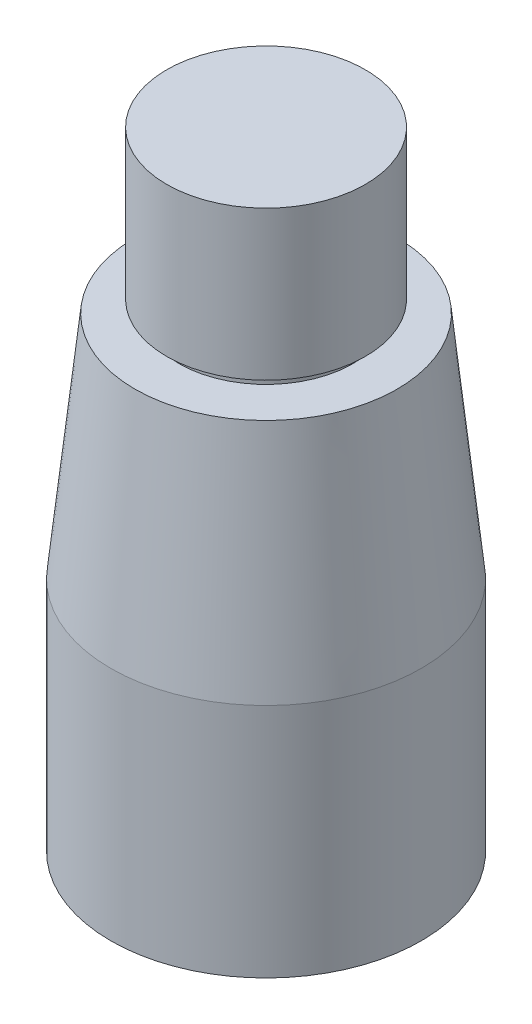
from build123d import *


with BuildPart() as part:
    # Sketch1 → Revolve1 (revolve)
    with BuildSketch(Plane.XY, mode=Mode.PRIVATE) as revolve1_sk:
        Polygon((0, 0), (-12.5, 0), (-12.5, 19), (-10.555571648, 37.5), (-7, 37.5), (-7, 38.5), (-8, 38.5), (-8, 50.5), (0, 50.5), align=None)
    revolve(revolve1_sk.sketch.rotate(Axis((0, 85.10264496, 0), (0, -1, 0)), 270), axis=Axis((0, 85.10264496, 0), (0, -1, 0)))


solid = part.part
